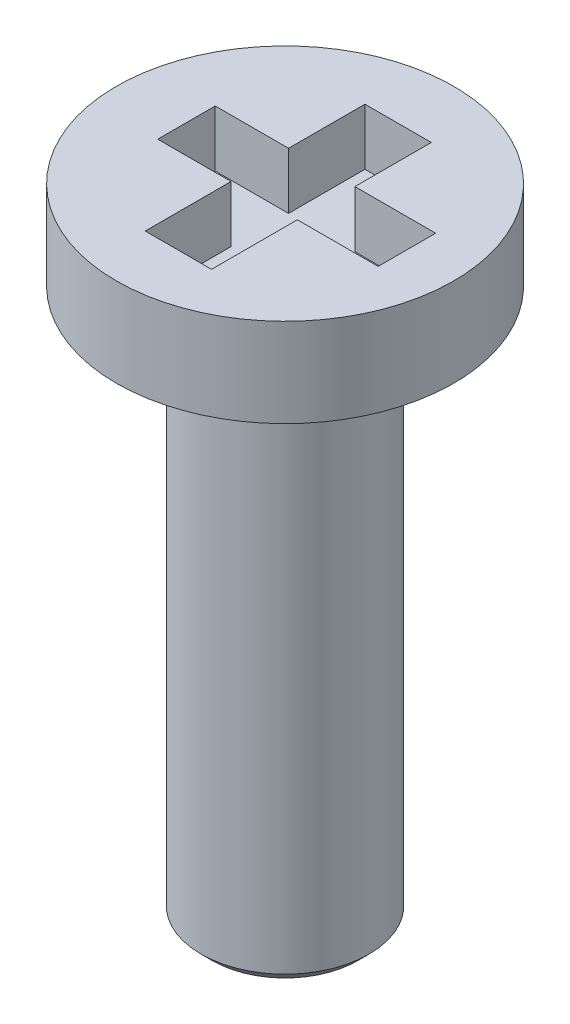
ISO-10303-21;
HEADER;
FILE_DESCRIPTION(('STEP AP214'),'2;1');
FILE_NAME('part.step','',(''),(''),'','','');
FILE_SCHEMA(('AUTOMOTIVE_DESIGN { 1 0 10303 214 1 1 1 1 }'));
ENDSEC;
DATA;
#1=APPLICATION_CONTEXT('core data for automotive mechanical design processes');
#2=APPLICATION_PROTOCOL_DEFINITION('international standard','automotive_design',2000,#1);
#3=PRODUCT_CONTEXT('',#1,'mechanical');
#4=PRODUCT('Part','Part','',(#3));
#5=PRODUCT_RELATED_PRODUCT_CATEGORY('part','',(#4));
#6=PRODUCT_DEFINITION_FORMATION('','',#4);
#7=PRODUCT_DEFINITION_CONTEXT('part definition',#1,'design');
#8=PRODUCT_DEFINITION('design','',#6,#7);
#9=PRODUCT_DEFINITION_SHAPE('','',#8);
#10=(LENGTH_UNIT() NAMED_UNIT(*) SI_UNIT(.MILLI.,.METRE.));
#11=(NAMED_UNIT(*) PLANE_ANGLE_UNIT() SI_UNIT($,.RADIAN.));
#12=(NAMED_UNIT(*) SI_UNIT($,.STERADIAN.) SOLID_ANGLE_UNIT());
#13=UNCERTAINTY_MEASURE_WITH_UNIT(LENGTH_MEASURE(1.E-05),#10,'distance_accuracy_value','');
#14=(GEOMETRIC_REPRESENTATION_CONTEXT(3) GLOBAL_UNCERTAINTY_ASSIGNED_CONTEXT((#13)) GLOBAL_UNIT_ASSIGNED_CONTEXT((#10,
#11,#12)) REPRESENTATION_CONTEXT('',''));
#15=CARTESIAN_POINT('',(0.,0.,0.));
#16=DIRECTION('',(0.,0.,1.));
#17=DIRECTION('',(1.,0.,0.));
#18=AXIS2_PLACEMENT_3D('',#15,#16,#17);
#19=CARTESIAN_POINT('',(0.,0.,0.));
#20=DIRECTION('',(0.,1.,0.));
#21=DIRECTION('',(0.,0.,1.));
#22=AXIS2_PLACEMENT_3D('',#19,#20,#21);
#23=PLANE('',#22);
#24=CARTESIAN_POINT('',(0.,0.,0.));
#25=DIRECTION('',(0.,1.,0.));
#26=DIRECTION('',(0.,0.,1.));
#27=AXIS2_PLACEMENT_3D('',#24,#25,#26);
#28=CIRCLE('',#27,1.29);
#29=CARTESIAN_POINT('',(0.,0.,1.29));
#30=VERTEX_POINT('',#29);
#31=EDGE_CURVE('E11',#30,#30,#28,.F.);
#32=ORIENTED_EDGE('',*,*,#31,.T.);
#33=EDGE_LOOP('',(#32));
#34=FACE_BOUND('',#33,.T.);
#35=ADVANCED_FACE('F33',(#34),#23,.F.);
#36=CARTESIAN_POINT('',(0.,19.6204093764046,0.));
#37=DIRECTION('',(0.,1.,0.));
#38=DIRECTION('',(0.,0.,1.));
#39=AXIS2_PLACEMENT_3D('',#36,#37,#38);
#40=CYLINDRICAL_SURFACE('',#39,1.49);
#41=CARTESIAN_POINT('',(0.,0.199999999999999,0.));
#42=DIRECTION('',(0.,1.,0.));
#43=DIRECTION('',(0.,0.,1.));
#44=AXIS2_PLACEMENT_3D('',#41,#42,#43);
#45=CIRCLE('',#44,1.49);
#46=CARTESIAN_POINT('',(0.,0.199999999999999,1.49));
#47=VERTEX_POINT('',#46);
#48=EDGE_CURVE('E41',#47,#47,#45,.T.);
#49=ORIENTED_EDGE('',*,*,#48,.T.);
#50=EDGE_LOOP('',(#49));
#51=FACE_BOUND('',#50,.T.);
#52=CARTESIAN_POINT('',(0.,9.71470560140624,0.));
#53=DIRECTION('',(0.,1.,0.));
#54=DIRECTION('',(0.,0.,1.));
#55=AXIS2_PLACEMENT_3D('',#52,#53,#54);
#56=CIRCLE('',#55,1.49);
#57=CARTESIAN_POINT('',(0.,9.71470560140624,1.49));
#58=VERTEX_POINT('',#57);
#59=EDGE_CURVE('E212',#58,#58,#56,.T.);
#60=ORIENTED_EDGE('',*,*,#59,.F.);
#61=EDGE_LOOP('',(#60));
#62=FACE_BOUND('',#61,.T.);
#63=ADVANCED_FACE('F217',(#51,#62),#40,.T.);
#64=CARTESIAN_POINT('',(1.49,9.71470560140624,0.));
#65=DIRECTION('',(0.,1.,0.));
#66=DIRECTION('',(0.,0.,1.));
#67=AXIS2_PLACEMENT_3D('',#64,#65,#66);
#68=PLANE('',#67);
#69=CARTESIAN_POINT('',(0.,9.71470560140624,0.));
#70=DIRECTION('',(0.,1.,0.));
#71=DIRECTION('',(0.,0.,1.));
#72=AXIS2_PLACEMENT_3D('',#69,#70,#71);
#73=CIRCLE('',#72,2.99);
#74=CARTESIAN_POINT('',(0.,9.71470560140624,2.99));
#75=VERTEX_POINT('',#74);
#76=EDGE_CURVE('E209',#75,#75,#73,.T.);
#77=ORIENTED_EDGE('',*,*,#76,.F.);
#78=EDGE_LOOP('',(#77));
#79=FACE_BOUND('',#78,.T.);
#80=ORIENTED_EDGE('',*,*,#59,.T.);
#81=EDGE_LOOP('',(#80));
#82=FACE_BOUND('',#81,.T.);
#83=ADVANCED_FACE('F233',(#79,#82),#68,.F.);
#84=CARTESIAN_POINT('',(0.,19.6204093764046,0.));
#85=DIRECTION('',(0.,1.,0.));
#86=DIRECTION('',(0.,0.,1.));
#87=AXIS2_PLACEMENT_3D('',#84,#85,#86);
#88=CYLINDRICAL_SURFACE('',#87,2.99);
#89=CARTESIAN_POINT('',(0.,11.2866992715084,0.));
#90=DIRECTION('',(0.,1.,0.));
#91=DIRECTION('',(0.,0.,1.));
#92=AXIS2_PLACEMENT_3D('',#89,#90,#91);
#93=CIRCLE('',#92,2.99);
#94=CARTESIAN_POINT('',(0.,11.2866992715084,2.99));
#95=VERTEX_POINT('',#94);
#96=EDGE_CURVE('E189',#95,#95,#93,.T.);
#97=ORIENTED_EDGE('',*,*,#96,.F.);
#98=EDGE_LOOP('',(#97));
#99=FACE_BOUND('',#98,.T.);
#100=ORIENTED_EDGE('',*,*,#76,.T.);
#101=EDGE_LOOP('',(#100));
#102=FACE_BOUND('',#101,.T.);
#103=ADVANCED_FACE('F238',(#99,#102),#88,.T.);
#104=CARTESIAN_POINT('',(2.99,11.2866992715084,0.));
#105=DIRECTION('',(0.,-1.,0.));
#106=DIRECTION('',(0.,0.,-1.));
#107=AXIS2_PLACEMENT_3D('',#104,#105,#106);
#108=PLANE('',#107);
#109=DIRECTION('',(1.,0.,0.));
#110=VECTOR('',#109,1.);
#111=CARTESIAN_POINT('',(-1.81140041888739,11.2866992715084,0.446429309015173));
#112=LINE('',#111,#110);
#113=CARTESIAN_POINT('',(-1.81140041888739,11.2866992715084,0.446429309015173));
#114=VERTEX_POINT('',#113);
#115=CARTESIAN_POINT('',(-0.511697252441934,11.2866992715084,0.446429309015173));
#116=VERTEX_POINT('',#115);
#117=EDGE_CURVE('E158',#114,#116,#112,.T.);
#118=ORIENTED_EDGE('',*,*,#117,.F.);
#119=DIRECTION('',(0.,0.,1.));
#120=VECTOR('',#119,1.);
#121=CARTESIAN_POINT('',(-1.81140041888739,11.2866992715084,-0.573573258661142));
#122=LINE('',#121,#120);
#123=CARTESIAN_POINT('',(-1.81140041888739,11.2866992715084,-0.573573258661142));
#124=VERTEX_POINT('',#123);
#125=EDGE_CURVE('E48',#124,#114,#122,.T.);
#126=ORIENTED_EDGE('',*,*,#125,.F.);
#127=DIRECTION('',(-1.,0.,0.));
#128=VECTOR('',#127,1.);
#129=CARTESIAN_POINT('',(-1.81140041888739,11.2866992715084,-0.573573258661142));
#130=LINE('',#129,#128);
#131=CARTESIAN_POINT('',(-0.511697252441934,11.2866992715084,-0.573573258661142));
#132=VERTEX_POINT('',#131);
#133=EDGE_CURVE('E185',#132,#124,#130,.T.);
#134=ORIENTED_EDGE('',*,*,#133,.F.);
#135=DIRECTION('',(0.,0.,1.));
#136=VECTOR('',#135,1.);
#137=CARTESIAN_POINT('',(-0.511697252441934,11.2866992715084,-1.92786079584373));
#138=LINE('',#137,#136);
#139=CARTESIAN_POINT('',(-0.511697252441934,11.2866992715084,-1.92786079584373));
#140=VERTEX_POINT('',#139);
#141=EDGE_CURVE('E183',#140,#132,#138,.T.);
#142=ORIENTED_EDGE('',*,*,#141,.F.);
#143=DIRECTION('',(-1.,0.,0.));
#144=VECTOR('',#143,1.);
#145=CARTESIAN_POINT('',(-0.511697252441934,11.2866992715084,-1.92786079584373));
#146=LINE('',#145,#144);
#147=CARTESIAN_POINT('',(0.664381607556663,11.2866992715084,-1.92786079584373));
#148=VERTEX_POINT('',#147);
#149=EDGE_CURVE('E132',#148,#140,#146,.T.);
#150=ORIENTED_EDGE('',*,*,#149,.F.);
#151=DIRECTION('',(0.,0.,-1.));
#152=VECTOR('',#151,1.);
#153=CARTESIAN_POINT('',(0.664381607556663,11.2866992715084,-1.92786079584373));
#154=LINE('',#153,#152);
#155=CARTESIAN_POINT('',(0.664381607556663,11.2866992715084,-0.573573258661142));
#156=VERTEX_POINT('',#155);
#157=EDGE_CURVE('E179',#156,#148,#154,.T.);
#158=ORIENTED_EDGE('',*,*,#157,.F.);
#159=DIRECTION('',(-1.,0.,0.));
#160=VECTOR('',#159,1.);
#161=CARTESIAN_POINT('',(0.664381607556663,11.2866992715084,-0.573573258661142));
#162=LINE('',#161,#160);
#163=CARTESIAN_POINT('',(2.09653912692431,11.2866992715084,-0.573573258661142));
#164=VERTEX_POINT('',#163);
#165=EDGE_CURVE('E176',#164,#156,#162,.T.);
#166=ORIENTED_EDGE('',*,*,#165,.F.);
#167=DIRECTION('',(0.,0.,-1.));
#168=VECTOR('',#167,1.);
#169=CARTESIAN_POINT('',(2.09653912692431,11.2866992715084,-0.573573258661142));
#170=LINE('',#169,#168);
#171=CARTESIAN_POINT('',(2.09653912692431,11.2866992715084,0.446429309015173));
#172=VERTEX_POINT('',#171);
#173=EDGE_CURVE('E173',#172,#164,#170,.T.);
#174=ORIENTED_EDGE('',*,*,#173,.F.);
#175=DIRECTION('',(1.,0.,0.));
#176=VECTOR('',#175,1.);
#177=CARTESIAN_POINT('',(0.664381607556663,11.2866992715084,0.446429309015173));
#178=LINE('',#177,#176);
#179=CARTESIAN_POINT('',(0.664381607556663,11.2866992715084,0.446429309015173));
#180=VERTEX_POINT('',#179);
#181=EDGE_CURVE('E170',#180,#172,#178,.T.);
#182=ORIENTED_EDGE('',*,*,#181,.F.);
#183=DIRECTION('',(0.,0.,-1.));
#184=VECTOR('',#183,1.);
#185=CARTESIAN_POINT('',(0.664381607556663,11.2866992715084,0.446429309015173));
#186=LINE('',#185,#184);
#187=CARTESIAN_POINT('',(0.664381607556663,11.2866992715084,1.9676710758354));
#188=VERTEX_POINT('',#187);
#189=EDGE_CURVE('E167',#188,#180,#186,.T.);
#190=ORIENTED_EDGE('',*,*,#189,.F.);
#191=DIRECTION('',(1.,0.,0.));
#192=VECTOR('',#191,1.);
#193=CARTESIAN_POINT('',(-0.511697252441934,11.2866992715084,1.9676710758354));
#194=LINE('',#193,#192);
#195=CARTESIAN_POINT('',(-0.511697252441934,11.2866992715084,1.9676710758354));
#196=VERTEX_POINT('',#195);
#197=EDGE_CURVE('E164',#196,#188,#194,.T.);
#198=ORIENTED_EDGE('',*,*,#197,.F.);
#199=DIRECTION('',(0.,0.,1.));
#200=VECTOR('',#199,1.);
#201=CARTESIAN_POINT('',(-0.511697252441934,11.2866992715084,0.446429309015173));
#202=LINE('',#201,#200);
#203=EDGE_CURVE('E161',#116,#196,#202,.T.);
#204=ORIENTED_EDGE('',*,*,#203,.F.);
#205=EDGE_LOOP('',(#118,#126,#134,#142,#150,#158,#166,#174,#182,#190,#198,#204));
#206=FACE_BOUND('',#205,.T.);
#207=ORIENTED_EDGE('',*,*,#96,.T.);
#208=EDGE_LOOP('',(#207));
#209=FACE_BOUND('',#208,.T.);
#210=ADVANCED_FACE('F242',(#206,#209),#108,.F.);
#211=CARTESIAN_POINT('',(-1.81140041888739,10.2866992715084,-0.573573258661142));
#212=DIRECTION('',(-1.,0.,0.));
#213=DIRECTION('',(0.,0.,1.));
#214=AXIS2_PLACEMENT_3D('',#211,#212,#213);
#215=PLANE('',#214);
#216=ORIENTED_EDGE('',*,*,#125,.T.);
#217=DIRECTION('',(0.,1.,0.));
#218=VECTOR('',#217,1.);
#219=CARTESIAN_POINT('',(-1.81140041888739,10.2866992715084,0.446429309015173));
#220=LINE('',#219,#218);
#221=CARTESIAN_POINT('',(-1.81140041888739,10.2866992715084,0.446429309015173));
#222=VERTEX_POINT('',#221);
#223=EDGE_CURVE('E96',#222,#114,#220,.T.);
#224=ORIENTED_EDGE('',*,*,#223,.F.);
#225=DIRECTION('',(0.,0.,1.));
#226=VECTOR('',#225,1.);
#227=CARTESIAN_POINT('',(-1.81140041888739,10.2866992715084,-0.573573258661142));
#228=LINE('',#227,#226);
#229=CARTESIAN_POINT('',(-1.81140041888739,10.2866992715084,-0.573573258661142));
#230=VERTEX_POINT('',#229);
#231=EDGE_CURVE('E187',#230,#222,#228,.T.);
#232=ORIENTED_EDGE('',*,*,#231,.F.);
#233=DIRECTION('',(0.,1.,0.));
#234=VECTOR('',#233,1.);
#235=CARTESIAN_POINT('',(-1.81140041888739,10.2866992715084,-0.573573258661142));
#236=LINE('',#235,#234);
#237=EDGE_CURVE('E56',#230,#124,#236,.T.);
#238=ORIENTED_EDGE('',*,*,#237,.T.);
#239=EDGE_LOOP('',(#216,#224,#232,#238));
#240=FACE_BOUND('',#239,.T.);
#241=ADVANCED_FACE('F246',(#240),#215,.F.);
#242=CARTESIAN_POINT('',(-1.81140041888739,10.2866992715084,-0.573573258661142));
#243=DIRECTION('',(0.,0.,-1.));
#244=DIRECTION('',(-1.,0.,0.));
#245=AXIS2_PLACEMENT_3D('',#242,#243,#244);
#246=PLANE('',#245);
#247=ORIENTED_EDGE('',*,*,#133,.T.);
#248=ORIENTED_EDGE('',*,*,#237,.F.);
#249=DIRECTION('',(-1.,0.,0.));
#250=VECTOR('',#249,1.);
#251=CARTESIAN_POINT('',(-1.81140041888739,10.2866992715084,-0.573573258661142));
#252=LINE('',#251,#250);
#253=CARTESIAN_POINT('',(-0.511697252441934,10.2866992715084,-0.573573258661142));
#254=VERTEX_POINT('',#253);
#255=EDGE_CURVE('E144',#254,#230,#252,.T.);
#256=ORIENTED_EDGE('',*,*,#255,.F.);
#257=DIRECTION('',(0.,1.,0.));
#258=VECTOR('',#257,1.);
#259=CARTESIAN_POINT('',(-0.511697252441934,10.2866992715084,-0.573573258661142));
#260=LINE('',#259,#258);
#261=EDGE_CURVE('E136',#254,#132,#260,.T.);
#262=ORIENTED_EDGE('',*,*,#261,.T.);
#263=EDGE_LOOP('',(#247,#248,#256,#262));
#264=FACE_BOUND('',#263,.T.);
#265=ADVANCED_FACE('F250',(#264),#246,.F.);
#266=CARTESIAN_POINT('',(-0.511697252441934,10.2866992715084,-1.92786079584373));
#267=DIRECTION('',(-1.,0.,0.));
#268=DIRECTION('',(0.,0.,1.));
#269=AXIS2_PLACEMENT_3D('',#266,#267,#268);
#270=PLANE('',#269);
#271=ORIENTED_EDGE('',*,*,#141,.T.);
#272=ORIENTED_EDGE('',*,*,#261,.F.);
#273=DIRECTION('',(0.,0.,1.));
#274=VECTOR('',#273,1.);
#275=CARTESIAN_POINT('',(-0.511697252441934,10.2866992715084,-1.92786079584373));
#276=LINE('',#275,#274);
#277=CARTESIAN_POINT('',(-0.511697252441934,10.2866992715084,-1.92786079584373));
#278=VERTEX_POINT('',#277);
#279=EDGE_CURVE('E140',#278,#254,#276,.T.);
#280=ORIENTED_EDGE('',*,*,#279,.F.);
#281=DIRECTION('',(0.,1.,0.));
#282=VECTOR('',#281,1.);
#283=CARTESIAN_POINT('',(-0.511697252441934,10.2866992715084,-1.92786079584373));
#284=LINE('',#283,#282);
#285=EDGE_CURVE('E125',#278,#140,#284,.T.);
#286=ORIENTED_EDGE('',*,*,#285,.T.);
#287=EDGE_LOOP('',(#271,#272,#280,#286));
#288=FACE_BOUND('',#287,.T.);
#289=ADVANCED_FACE('F141',(#288),#270,.F.);
#290=CARTESIAN_POINT('',(-0.511697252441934,10.2866992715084,-1.92786079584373));
#291=DIRECTION('',(0.,0.,-1.));
#292=DIRECTION('',(-1.,0.,0.));
#293=AXIS2_PLACEMENT_3D('',#290,#291,#292);
#294=PLANE('',#293);
#295=ORIENTED_EDGE('',*,*,#149,.T.);
#296=ORIENTED_EDGE('',*,*,#285,.F.);
#297=DIRECTION('',(-1.,0.,0.));
#298=VECTOR('',#297,1.);
#299=CARTESIAN_POINT('',(-0.511697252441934,10.2866992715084,-1.92786079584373));
#300=LINE('',#299,#298);
#301=CARTESIAN_POINT('',(0.664381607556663,10.2866992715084,-1.92786079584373));
#302=VERTEX_POINT('',#301);
#303=EDGE_CURVE('E129',#302,#278,#300,.T.);
#304=ORIENTED_EDGE('',*,*,#303,.F.);
#305=DIRECTION('',(0.,1.,0.));
#306=VECTOR('',#305,1.);
#307=CARTESIAN_POINT('',(0.664381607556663,10.2866992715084,-1.92786079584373));
#308=LINE('',#307,#306);
#309=EDGE_CURVE('E137',#302,#148,#308,.T.);
#310=ORIENTED_EDGE('',*,*,#309,.T.);
#311=EDGE_LOOP('',(#295,#296,#304,#310));
#312=FACE_BOUND('',#311,.T.);
#313=ADVANCED_FACE('F127',(#312),#294,.F.);
#314=CARTESIAN_POINT('',(0.664381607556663,10.2866992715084,-1.92786079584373));
#315=DIRECTION('',(1.,0.,0.));
#316=DIRECTION('',(0.,0.,-1.));
#317=AXIS2_PLACEMENT_3D('',#314,#315,#316);
#318=PLANE('',#317);
#319=ORIENTED_EDGE('',*,*,#157,.T.);
#320=ORIENTED_EDGE('',*,*,#309,.F.);
#321=DIRECTION('',(0.,0.,-1.));
#322=VECTOR('',#321,1.);
#323=CARTESIAN_POINT('',(0.664381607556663,10.2866992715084,-1.92786079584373));
#324=LINE('',#323,#322);
#325=CARTESIAN_POINT('',(0.664381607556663,10.2866992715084,-0.573573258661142));
#326=VERTEX_POINT('',#325);
#327=EDGE_CURVE('E150',#326,#302,#324,.T.);
#328=ORIENTED_EDGE('',*,*,#327,.F.);
#329=DIRECTION('',(0.,1.,0.));
#330=VECTOR('',#329,1.);
#331=CARTESIAN_POINT('',(0.664381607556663,10.2866992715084,-0.573573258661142));
#332=LINE('',#331,#330);
#333=EDGE_CURVE('E192',#326,#156,#332,.T.);
#334=ORIENTED_EDGE('',*,*,#333,.T.);
#335=EDGE_LOOP('',(#319,#320,#328,#334));
#336=FACE_BOUND('',#335,.T.);
#337=ADVANCED_FACE('F277',(#336),#318,.F.);
#338=CARTESIAN_POINT('',(0.664381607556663,10.2866992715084,-0.573573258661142));
#339=DIRECTION('',(0.,0.,-1.));
#340=DIRECTION('',(-1.,0.,0.));
#341=AXIS2_PLACEMENT_3D('',#338,#339,#340);
#342=PLANE('',#341);
#343=ORIENTED_EDGE('',*,*,#165,.T.);
#344=ORIENTED_EDGE('',*,*,#333,.F.);
#345=DIRECTION('',(-1.,0.,0.));
#346=VECTOR('',#345,1.);
#347=CARTESIAN_POINT('',(0.664381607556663,10.2866992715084,-0.573573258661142));
#348=LINE('',#347,#346);
#349=CARTESIAN_POINT('',(2.09653912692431,10.2866992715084,-0.573573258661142));
#350=VERTEX_POINT('',#349);
#351=EDGE_CURVE('E152',#350,#326,#348,.T.);
#352=ORIENTED_EDGE('',*,*,#351,.F.);
#353=DIRECTION('',(0.,1.,0.));
#354=VECTOR('',#353,1.);
#355=CARTESIAN_POINT('',(2.09653912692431,10.2866992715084,-0.573573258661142));
#356=LINE('',#355,#354);
#357=EDGE_CURVE('E194',#350,#164,#356,.T.);
#358=ORIENTED_EDGE('',*,*,#357,.T.);
#359=EDGE_LOOP('',(#343,#344,#352,#358));
#360=FACE_BOUND('',#359,.T.);
#361=ADVANCED_FACE('F273',(#360),#342,.F.);
#362=CARTESIAN_POINT('',(2.09653912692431,10.2866992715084,-0.573573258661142));
#363=DIRECTION('',(1.,0.,0.));
#364=DIRECTION('',(0.,0.,-1.));
#365=AXIS2_PLACEMENT_3D('',#362,#363,#364);
#366=PLANE('',#365);
#367=ORIENTED_EDGE('',*,*,#173,.T.);
#368=ORIENTED_EDGE('',*,*,#357,.F.);
#369=DIRECTION('',(0.,0.,-1.));
#370=VECTOR('',#369,1.);
#371=CARTESIAN_POINT('',(2.09653912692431,10.2866992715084,-0.573573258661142));
#372=LINE('',#371,#370);
#373=CARTESIAN_POINT('',(2.09653912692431,10.2866992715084,0.446429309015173));
#374=VERTEX_POINT('',#373);
#375=EDGE_CURVE('E312',#374,#350,#372,.T.);
#376=ORIENTED_EDGE('',*,*,#375,.F.);
#377=DIRECTION('',(0.,1.,0.));
#378=VECTOR('',#377,1.);
#379=CARTESIAN_POINT('',(2.09653912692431,10.2866992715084,0.446429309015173));
#380=LINE('',#379,#378);
#381=EDGE_CURVE('E196',#374,#172,#380,.T.);
#382=ORIENTED_EDGE('',*,*,#381,.T.);
#383=EDGE_LOOP('',(#367,#368,#376,#382));
#384=FACE_BOUND('',#383,.T.);
#385=ADVANCED_FACE('F269',(#384),#366,.F.);
#386=CARTESIAN_POINT('',(0.664381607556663,10.2866992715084,0.446429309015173));
#387=DIRECTION('',(0.,0.,1.));
#388=DIRECTION('',(1.,0.,0.));
#389=AXIS2_PLACEMENT_3D('',#386,#387,#388);
#390=PLANE('',#389);
#391=ORIENTED_EDGE('',*,*,#181,.T.);
#392=ORIENTED_EDGE('',*,*,#381,.F.);
#393=DIRECTION('',(1.,0.,0.));
#394=VECTOR('',#393,1.);
#395=CARTESIAN_POINT('',(0.664381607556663,10.2866992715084,0.446429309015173));
#396=LINE('',#395,#394);
#397=CARTESIAN_POINT('',(0.664381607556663,10.2866992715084,0.446429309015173));
#398=VERTEX_POINT('',#397);
#399=EDGE_CURVE('E309',#398,#374,#396,.T.);
#400=ORIENTED_EDGE('',*,*,#399,.F.);
#401=DIRECTION('',(0.,1.,0.));
#402=VECTOR('',#401,1.);
#403=CARTESIAN_POINT('',(0.664381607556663,10.2866992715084,0.446429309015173));
#404=LINE('',#403,#402);
#405=EDGE_CURVE('E198',#398,#180,#404,.T.);
#406=ORIENTED_EDGE('',*,*,#405,.T.);
#407=EDGE_LOOP('',(#391,#392,#400,#406));
#408=FACE_BOUND('',#407,.T.);
#409=ADVANCED_FACE('F265',(#408),#390,.F.);
#410=CARTESIAN_POINT('',(0.664381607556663,10.2866992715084,0.446429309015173));
#411=DIRECTION('',(1.,0.,0.));
#412=DIRECTION('',(0.,0.,-1.));
#413=AXIS2_PLACEMENT_3D('',#410,#411,#412);
#414=PLANE('',#413);
#415=ORIENTED_EDGE('',*,*,#189,.T.);
#416=ORIENTED_EDGE('',*,*,#405,.F.);
#417=DIRECTION('',(0.,0.,-1.));
#418=VECTOR('',#417,1.);
#419=CARTESIAN_POINT('',(0.664381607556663,10.2866992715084,0.446429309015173));
#420=LINE('',#419,#418);
#421=CARTESIAN_POINT('',(0.664381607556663,10.2866992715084,1.9676710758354));
#422=VERTEX_POINT('',#421);
#423=EDGE_CURVE('E306',#422,#398,#420,.T.);
#424=ORIENTED_EDGE('',*,*,#423,.F.);
#425=DIRECTION('',(0.,1.,0.));
#426=VECTOR('',#425,1.);
#427=CARTESIAN_POINT('',(0.664381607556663,10.2866992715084,1.9676710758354));
#428=LINE('',#427,#426);
#429=EDGE_CURVE('E200',#422,#188,#428,.T.);
#430=ORIENTED_EDGE('',*,*,#429,.T.);
#431=EDGE_LOOP('',(#415,#416,#424,#430));
#432=FACE_BOUND('',#431,.T.);
#433=ADVANCED_FACE('F261',(#432),#414,.F.);
#434=CARTESIAN_POINT('',(-0.511697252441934,10.2866992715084,1.9676710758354));
#435=DIRECTION('',(0.,0.,1.));
#436=DIRECTION('',(1.,0.,0.));
#437=AXIS2_PLACEMENT_3D('',#434,#435,#436);
#438=PLANE('',#437);
#439=ORIENTED_EDGE('',*,*,#197,.T.);
#440=ORIENTED_EDGE('',*,*,#429,.F.);
#441=DIRECTION('',(1.,0.,0.));
#442=VECTOR('',#441,1.);
#443=CARTESIAN_POINT('',(-0.511697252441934,10.2866992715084,1.9676710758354));
#444=LINE('',#443,#442);
#445=CARTESIAN_POINT('',(-0.511697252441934,10.2866992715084,1.9676710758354));
#446=VERTEX_POINT('',#445);
#447=EDGE_CURVE('E303',#446,#422,#444,.T.);
#448=ORIENTED_EDGE('',*,*,#447,.F.);
#449=DIRECTION('',(0.,1.,0.));
#450=VECTOR('',#449,1.);
#451=CARTESIAN_POINT('',(-0.511697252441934,10.2866992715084,1.9676710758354));
#452=LINE('',#451,#450);
#453=EDGE_CURVE('E202',#446,#196,#452,.T.);
#454=ORIENTED_EDGE('',*,*,#453,.T.);
#455=EDGE_LOOP('',(#439,#440,#448,#454));
#456=FACE_BOUND('',#455,.T.);
#457=ADVANCED_FACE('F257',(#456),#438,.F.);
#458=CARTESIAN_POINT('',(-0.511697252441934,10.2866992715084,0.446429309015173));
#459=DIRECTION('',(-1.,0.,0.));
#460=DIRECTION('',(0.,0.,1.));
#461=AXIS2_PLACEMENT_3D('',#458,#459,#460);
#462=PLANE('',#461);
#463=ORIENTED_EDGE('',*,*,#203,.T.);
#464=ORIENTED_EDGE('',*,*,#453,.F.);
#465=DIRECTION('',(0.,0.,1.));
#466=VECTOR('',#465,1.);
#467=CARTESIAN_POINT('',(-0.511697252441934,10.2866992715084,0.446429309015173));
#468=LINE('',#467,#466);
#469=CARTESIAN_POINT('',(-0.511697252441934,10.2866992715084,0.446429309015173));
#470=VERTEX_POINT('',#469);
#471=EDGE_CURVE('E298',#470,#446,#468,.T.);
#472=ORIENTED_EDGE('',*,*,#471,.F.);
#473=DIRECTION('',(0.,1.,0.));
#474=VECTOR('',#473,1.);
#475=CARTESIAN_POINT('',(-0.511697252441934,10.2866992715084,0.446429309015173));
#476=LINE('',#475,#474);
#477=EDGE_CURVE('E204',#470,#116,#476,.T.);
#478=ORIENTED_EDGE('',*,*,#477,.T.);
#479=EDGE_LOOP('',(#463,#464,#472,#478));
#480=FACE_BOUND('',#479,.T.);
#481=ADVANCED_FACE('F253',(#480),#462,.F.);
#482=CARTESIAN_POINT('',(-1.81140041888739,10.2866992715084,0.446429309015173));
#483=DIRECTION('',(0.,0.,1.));
#484=DIRECTION('',(1.,0.,0.));
#485=AXIS2_PLACEMENT_3D('',#482,#483,#484);
#486=PLANE('',#485);
#487=ORIENTED_EDGE('',*,*,#117,.T.);
#488=ORIENTED_EDGE('',*,*,#477,.F.);
#489=DIRECTION('',(1.,0.,0.));
#490=VECTOR('',#489,1.);
#491=CARTESIAN_POINT('',(-1.81140041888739,10.2866992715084,0.446429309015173));
#492=LINE('',#491,#490);
#493=EDGE_CURVE('E296',#222,#470,#492,.T.);
#494=ORIENTED_EDGE('',*,*,#493,.F.);
#495=ORIENTED_EDGE('',*,*,#223,.T.);
#496=EDGE_LOOP('',(#487,#488,#494,#495));
#497=FACE_BOUND('',#496,.T.);
#498=ADVANCED_FACE('F225',(#497),#486,.F.);
#499=CARTESIAN_POINT('',(-1.81140041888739,10.2866992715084,0.446429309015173));
#500=DIRECTION('',(0.,1.,0.));
#501=DIRECTION('',(0.,0.,1.));
#502=AXIS2_PLACEMENT_3D('',#499,#500,#501);
#503=PLANE('',#502);
#504=ORIENTED_EDGE('',*,*,#231,.T.);
#505=ORIENTED_EDGE('',*,*,#493,.T.);
#506=ORIENTED_EDGE('',*,*,#471,.T.);
#507=ORIENTED_EDGE('',*,*,#447,.T.);
#508=ORIENTED_EDGE('',*,*,#423,.T.);
#509=ORIENTED_EDGE('',*,*,#399,.T.);
#510=ORIENTED_EDGE('',*,*,#375,.T.);
#511=ORIENTED_EDGE('',*,*,#351,.T.);
#512=ORIENTED_EDGE('',*,*,#327,.T.);
#513=ORIENTED_EDGE('',*,*,#303,.T.);
#514=ORIENTED_EDGE('',*,*,#279,.T.);
#515=ORIENTED_EDGE('',*,*,#255,.T.);
#516=EDGE_LOOP('',(#504,#505,#506,#507,#508,#509,#510,#511,#512,#513,#514,#515));
#517=FACE_BOUND('',#516,.T.);
#518=ADVANCED_FACE('F147',(#517),#503,.T.);
#519=CARTESIAN_POINT('',(0.,0.199999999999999,0.));
#520=DIRECTION('',(0.,1.,0.));
#521=DIRECTION('',(0.,0.,1.));
#522=AXIS2_PLACEMENT_3D('',#519,#520,#521);
#523=CONICAL_SURFACE('',#522,1.49,0.785398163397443);
#524=ORIENTED_EDGE('',*,*,#31,.F.);
#525=EDGE_LOOP('',(#524));
#526=FACE_BOUND('',#525,.T.);
#527=ORIENTED_EDGE('',*,*,#48,.F.);
#528=EDGE_LOOP('',(#527));
#529=FACE_BOUND('',#528,.T.);
#530=ADVANCED_FACE('F35',(#526,#529),#523,.T.);
#531=CLOSED_SHELL('',(#35,#63,#83,#103,#210,#241,#265,#289,#313,#337,#361,#385,#409,#433,#457,
#481,#498,#518,#530));
#532=MANIFOLD_SOLID_BREP('B2',#531);
#533=ADVANCED_BREP_SHAPE_REPRESENTATION('',(#18,#532),#14);
#534=SHAPE_DEFINITION_REPRESENTATION(#9,#533);
ENDSEC;
END-ISO-10303-21;
